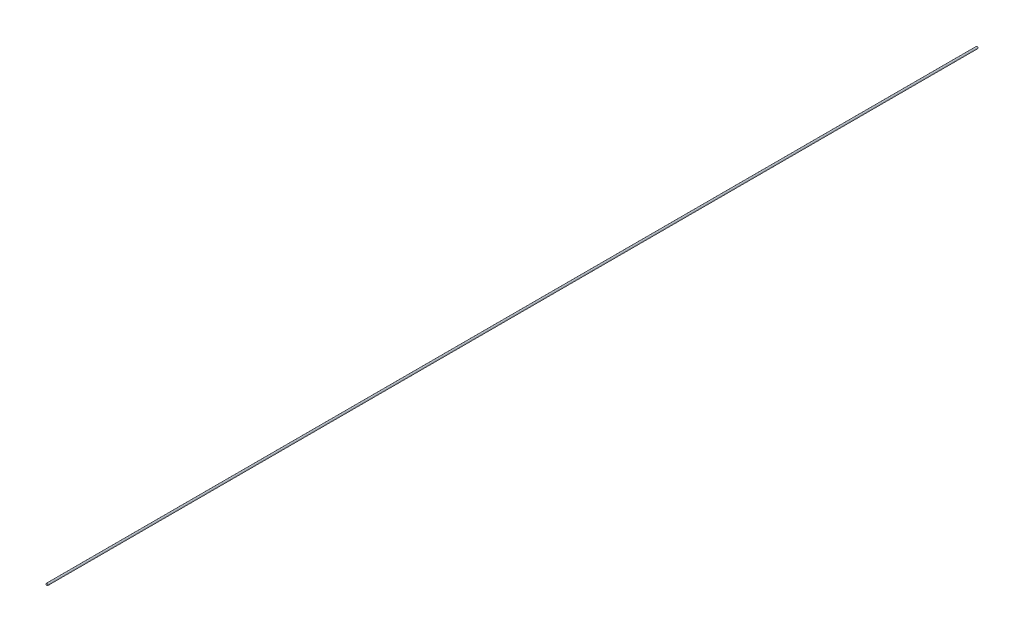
ISO-10303-21;
HEADER;
FILE_DESCRIPTION(('STEP AP214'),'2;1');
FILE_NAME('part.step','',(''),(''),'','','');
FILE_SCHEMA(('AUTOMOTIVE_DESIGN { 1 0 10303 214 1 1 1 1 }'));
ENDSEC;
DATA;
#1=APPLICATION_CONTEXT('core data for automotive mechanical design processes');
#2=APPLICATION_PROTOCOL_DEFINITION('international standard','automotive_design',2000,#1);
#3=PRODUCT_CONTEXT('',#1,'mechanical');
#4=PRODUCT('Part','Part','',(#3));
#5=PRODUCT_RELATED_PRODUCT_CATEGORY('part','',(#4));
#6=PRODUCT_DEFINITION_FORMATION('','',#4);
#7=PRODUCT_DEFINITION_CONTEXT('part definition',#1,'design');
#8=PRODUCT_DEFINITION('design','',#6,#7);
#9=PRODUCT_DEFINITION_SHAPE('','',#8);
#10=(LENGTH_UNIT() NAMED_UNIT(*) SI_UNIT(.MILLI.,.METRE.));
#11=(NAMED_UNIT(*) PLANE_ANGLE_UNIT() SI_UNIT($,.RADIAN.));
#12=(NAMED_UNIT(*) SI_UNIT($,.STERADIAN.) SOLID_ANGLE_UNIT());
#13=UNCERTAINTY_MEASURE_WITH_UNIT(LENGTH_MEASURE(1.E-05),#10,'distance_accuracy_value','');
#14=(GEOMETRIC_REPRESENTATION_CONTEXT(3) GLOBAL_UNCERTAINTY_ASSIGNED_CONTEXT((#13)) GLOBAL_UNIT_ASSIGNED_CONTEXT((#10,
#11,#12)) REPRESENTATION_CONTEXT('',''));
#15=CARTESIAN_POINT('',(0.,0.,0.));
#16=DIRECTION('',(0.,0.,1.));
#17=DIRECTION('',(1.,0.,0.));
#18=AXIS2_PLACEMENT_3D('',#15,#16,#17);
#19=CARTESIAN_POINT('',(2.00000000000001,-7.22499999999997,-120.));
#20=DIRECTION('',(0.,0.,-1.));
#21=DIRECTION('',(-1.,0.,0.));
#22=AXIS2_PLACEMENT_3D('',#19,#20,#21);
#23=PLANE('',#22);
#24=CARTESIAN_POINT('',(2.00000000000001,-7.22499999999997,-120.));
#25=DIRECTION('',(0.,0.,-1.));
#26=DIRECTION('',(-1.,0.,0.));
#27=AXIS2_PLACEMENT_3D('',#24,#25,#26);
#28=CIRCLE('',#27,0.125);
#29=CARTESIAN_POINT('',(1.87500000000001,-7.22499999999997,-120.));
#30=VERTEX_POINT('',#29);
#31=EDGE_CURVE('E17',#30,#30,#28,.F.);
#32=ORIENTED_EDGE('',*,*,#31,.F.);
#33=EDGE_LOOP('',(#32));
#34=FACE_BOUND('',#33,.T.);
#35=ADVANCED_FACE('F14',(#34),#23,.T.);
#36=CARTESIAN_POINT('',(2.00000000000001,-7.22499999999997,0.));
#37=DIRECTION('',(0.,0.,-1.));
#38=DIRECTION('',(-1.,0.,0.));
#39=AXIS2_PLACEMENT_3D('',#36,#37,#38);
#40=PLANE('',#39);
#41=CARTESIAN_POINT('',(2.00000000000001,-7.22499999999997,0.));
#42=DIRECTION('',(0.,0.,-1.));
#43=DIRECTION('',(-1.,0.,0.));
#44=AXIS2_PLACEMENT_3D('',#41,#42,#43);
#45=CIRCLE('',#44,0.125);
#46=CARTESIAN_POINT('',(1.87500000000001,-7.22499999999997,0.));
#47=VERTEX_POINT('',#46);
#48=EDGE_CURVE('E9',#47,#47,#45,.T.);
#49=ORIENTED_EDGE('',*,*,#48,.F.);
#50=EDGE_LOOP('',(#49));
#51=FACE_BOUND('',#50,.T.);
#52=ADVANCED_FACE('F29',(#51),#40,.F.);
#53=CARTESIAN_POINT('',(2.00000000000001,-7.22499999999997,0.));
#54=DIRECTION('',(0.,0.,-1.));
#55=DIRECTION('',(-1.,0.,0.));
#56=AXIS2_PLACEMENT_3D('',#53,#54,#55);
#57=CYLINDRICAL_SURFACE('',#56,0.125);
#58=ORIENTED_EDGE('',*,*,#48,.T.);
#59=EDGE_LOOP('',(#58));
#60=FACE_BOUND('',#59,.T.);
#61=ORIENTED_EDGE('',*,*,#31,.T.);
#62=EDGE_LOOP('',(#61));
#63=FACE_BOUND('',#62,.T.);
#64=ADVANCED_FACE('F26',(#60,#63),#57,.T.);
#65=CLOSED_SHELL('',(#35,#52,#64));
#66=MANIFOLD_SOLID_BREP('B1',#65);
#67=ADVANCED_BREP_SHAPE_REPRESENTATION('',(#18,#66),#14);
#68=SHAPE_DEFINITION_REPRESENTATION(#9,#67);
ENDSEC;
END-ISO-10303-21;
